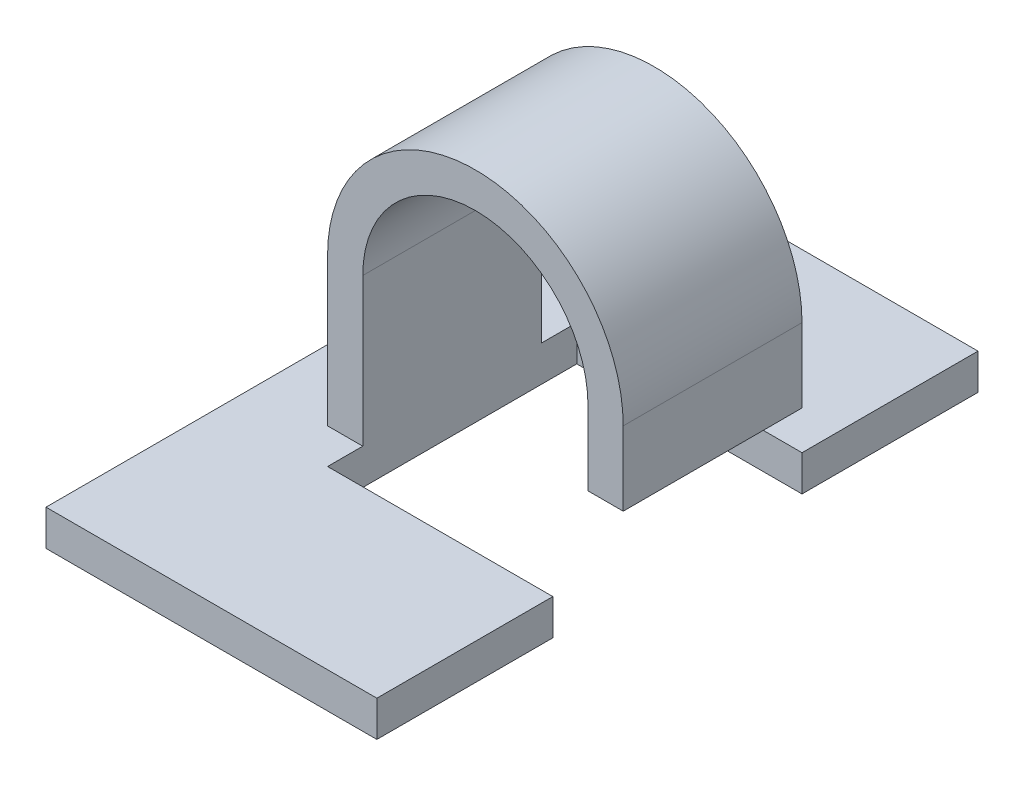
ISO-10303-21;
HEADER;
FILE_DESCRIPTION(('STEP AP214'),'2;1');
FILE_NAME('part.step','',(''),(''),'','','');
FILE_SCHEMA(('AUTOMOTIVE_DESIGN { 1 0 10303 214 1 1 1 1 }'));
ENDSEC;
DATA;
#1=APPLICATION_CONTEXT('core data for automotive mechanical design processes');
#2=APPLICATION_PROTOCOL_DEFINITION('international standard','automotive_design',2000,#1);
#3=PRODUCT_CONTEXT('',#1,'mechanical');
#4=PRODUCT('Part','Part','',(#3));
#5=PRODUCT_RELATED_PRODUCT_CATEGORY('part','',(#4));
#6=PRODUCT_DEFINITION_FORMATION('','',#4);
#7=PRODUCT_DEFINITION_CONTEXT('part definition',#1,'design');
#8=PRODUCT_DEFINITION('design','',#6,#7);
#9=PRODUCT_DEFINITION_SHAPE('','',#8);
#10=(LENGTH_UNIT() NAMED_UNIT(*) SI_UNIT(.MILLI.,.METRE.));
#11=(NAMED_UNIT(*) PLANE_ANGLE_UNIT() SI_UNIT($,.RADIAN.));
#12=(NAMED_UNIT(*) SI_UNIT($,.STERADIAN.) SOLID_ANGLE_UNIT());
#13=UNCERTAINTY_MEASURE_WITH_UNIT(LENGTH_MEASURE(1.E-05),#10,'distance_accuracy_value','');
#14=(GEOMETRIC_REPRESENTATION_CONTEXT(3) GLOBAL_UNCERTAINTY_ASSIGNED_CONTEXT((#13)) GLOBAL_UNIT_ASSIGNED_CONTEXT((#10,
#11,#12)) REPRESENTATION_CONTEXT('',''));
#15=CARTESIAN_POINT('',(0.,0.,0.));
#16=DIRECTION('',(0.,0.,1.));
#17=DIRECTION('',(1.,0.,0.));
#18=AXIS2_PLACEMENT_3D('',#15,#16,#17);
#19=CARTESIAN_POINT('',(0.,0.,-2.54));
#20=DIRECTION('',(0.,0.,1.));
#21=DIRECTION('',(1.,0.,0.));
#22=AXIS2_PLACEMENT_3D('',#19,#20,#21);
#23=CYLINDRICAL_SURFACE('',#22,3.2);
#24=CARTESIAN_POINT('',(0.,0.,2.54));
#25=DIRECTION('',(0.,0.,-1.));
#26=DIRECTION('',(-1.,0.,0.));
#27=AXIS2_PLACEMENT_3D('',#24,#25,#26);
#28=CIRCLE('',#27,3.2);
#29=CARTESIAN_POINT('',(-3.2,0.,2.54));
#30=VERTEX_POINT('',#29);
#31=CARTESIAN_POINT('',(3.2,0.,2.54));
#32=VERTEX_POINT('',#31);
#33=EDGE_CURVE('E141',#30,#32,#28,.T.);
#34=ORIENTED_EDGE('',*,*,#33,.F.);
#35=DIRECTION('',(0.,0.,1.));
#36=VECTOR('',#35,1.);
#37=CARTESIAN_POINT('',(-3.2,0.,-2.54));
#38=LINE('',#37,#36);
#39=CARTESIAN_POINT('',(-3.2,0.,-2.54));
#40=VERTEX_POINT('',#39);
#41=EDGE_CURVE('E11',#40,#30,#38,.T.);
#42=ORIENTED_EDGE('',*,*,#41,.F.);
#43=CARTESIAN_POINT('',(0.,0.,-2.54));
#44=DIRECTION('',(0.,0.,-1.));
#45=DIRECTION('',(-1.,0.,0.));
#46=AXIS2_PLACEMENT_3D('',#43,#44,#45);
#47=CIRCLE('',#46,3.2);
#48=CARTESIAN_POINT('',(3.2,0.,-2.54));
#49=VERTEX_POINT('',#48);
#50=EDGE_CURVE('E152',#40,#49,#47,.T.);
#51=ORIENTED_EDGE('',*,*,#50,.T.);
#52=DIRECTION('',(0.,0.,1.));
#53=VECTOR('',#52,1.);
#54=CARTESIAN_POINT('',(3.2,0.,-2.54));
#55=LINE('',#54,#53);
#56=EDGE_CURVE('E94',#49,#32,#55,.T.);
#57=ORIENTED_EDGE('',*,*,#56,.T.);
#58=EDGE_LOOP('',(#34,#42,#51,#57));
#59=FACE_BOUND('',#58,.T.);
#60=ADVANCED_FACE('F36',(#59),#23,.F.);
#61=CARTESIAN_POINT('',(-3.2,-4.2,-2.54));
#62=DIRECTION('',(1.,0.,0.));
#63=DIRECTION('',(0.,0.,-1.));
#64=AXIS2_PLACEMENT_3D('',#61,#62,#63);
#65=PLANE('',#64);
#66=DIRECTION('',(0.,1.,0.));
#67=VECTOR('',#66,1.);
#68=CARTESIAN_POINT('',(-3.2,-4.2,2.54));
#69=LINE('',#68,#67);
#70=CARTESIAN_POINT('',(-3.2,-4.2,2.54));
#71=VERTEX_POINT('',#70);
#72=EDGE_CURVE('E150',#71,#30,#69,.T.);
#73=ORIENTED_EDGE('',*,*,#72,.F.);
#74=DIRECTION('',(0.,0.,1.));
#75=VECTOR('',#74,1.);
#76=CARTESIAN_POINT('',(-3.2,-4.2,3.54));
#77=LINE('',#76,#75);
#78=CARTESIAN_POINT('',(-3.2,-4.2,3.54));
#79=VERTEX_POINT('',#78);
#80=EDGE_CURVE('E158',#71,#79,#77,.T.);
#81=ORIENTED_EDGE('',*,*,#80,.T.);
#82=DIRECTION('',(0.,1.,0.));
#83=VECTOR('',#82,1.);
#84=CARTESIAN_POINT('',(-3.2,-5.216,3.54));
#85=LINE('',#84,#83);
#86=CARTESIAN_POINT('',(-3.2,-5.216,3.54));
#87=VERTEX_POINT('',#86);
#88=EDGE_CURVE('E319',#87,#79,#85,.T.);
#89=ORIENTED_EDGE('',*,*,#88,.F.);
#90=DIRECTION('',(0.,0.,1.));
#91=VECTOR('',#90,1.);
#92=CARTESIAN_POINT('',(-3.2,-5.216,3.54));
#93=LINE('',#92,#91);
#94=CARTESIAN_POINT('',(-3.2,-5.216,-3.54));
#95=VERTEX_POINT('',#94);
#96=EDGE_CURVE('E326',#95,#87,#93,.T.);
#97=ORIENTED_EDGE('',*,*,#96,.F.);
#98=DIRECTION('',(0.,1.,0.));
#99=VECTOR('',#98,1.);
#100=CARTESIAN_POINT('',(-3.2,-5.216,-3.54));
#101=LINE('',#100,#99);
#102=CARTESIAN_POINT('',(-3.2,-4.2,-3.54));
#103=VERTEX_POINT('',#102);
#104=EDGE_CURVE('E288',#95,#103,#101,.T.);
#105=ORIENTED_EDGE('',*,*,#104,.T.);
#106=CARTESIAN_POINT('',(-3.2,-4.2,-2.54));
#107=VERTEX_POINT('',#106);
#108=EDGE_CURVE('E192',#103,#107,#77,.T.);
#109=ORIENTED_EDGE('',*,*,#108,.T.);
#110=DIRECTION('',(0.,1.,0.));
#111=VECTOR('',#110,1.);
#112=CARTESIAN_POINT('',(-3.2,-4.2,-2.54));
#113=LINE('',#112,#111);
#114=EDGE_CURVE('E146',#107,#40,#113,.T.);
#115=ORIENTED_EDGE('',*,*,#114,.T.);
#116=ORIENTED_EDGE('',*,*,#41,.T.);
#117=EDGE_LOOP('',(#73,#81,#89,#97,#105,#109,#115,#116));
#118=FACE_BOUND('',#117,.T.);
#119=ADVANCED_FACE('F189',(#118),#65,.T.);
#120=CARTESIAN_POINT('',(-4.2,0.,-2.54));
#121=DIRECTION('',(-1.,0.,0.));
#122=DIRECTION('',(0.,0.,1.));
#123=AXIS2_PLACEMENT_3D('',#120,#121,#122);
#124=PLANE('',#123);
#125=DIRECTION('',(0.,-1.,0.));
#126=VECTOR('',#125,1.);
#127=CARTESIAN_POINT('',(-4.2,0.,2.54));
#128=LINE('',#127,#126);
#129=CARTESIAN_POINT('',(-4.2,0.,2.54));
#130=VERTEX_POINT('',#129);
#131=CARTESIAN_POINT('',(-4.2,-4.2,2.54));
#132=VERTEX_POINT('',#131);
#133=EDGE_CURVE('E115',#130,#132,#128,.T.);
#134=ORIENTED_EDGE('',*,*,#133,.F.);
#135=DIRECTION('',(0.,0.,1.));
#136=VECTOR('',#135,1.);
#137=CARTESIAN_POINT('',(-4.2,0.,-2.54));
#138=LINE('',#137,#136);
#139=CARTESIAN_POINT('',(-4.2,0.,-2.54));
#140=VERTEX_POINT('',#139);
#141=EDGE_CURVE('E110',#140,#130,#138,.T.);
#142=ORIENTED_EDGE('',*,*,#141,.F.);
#143=DIRECTION('',(0.,-1.,0.));
#144=VECTOR('',#143,1.);
#145=CARTESIAN_POINT('',(-4.2,0.,-2.54));
#146=LINE('',#145,#144);
#147=CARTESIAN_POINT('',(-4.2,-4.2,-2.54));
#148=VERTEX_POINT('',#147);
#149=EDGE_CURVE('E113',#140,#148,#146,.T.);
#150=ORIENTED_EDGE('',*,*,#149,.T.);
#151=DIRECTION('',(0.,0.,1.));
#152=VECTOR('',#151,1.);
#153=CARTESIAN_POINT('',(-4.2,-4.2,-2.54));
#154=LINE('',#153,#152);
#155=EDGE_CURVE('E45',#148,#132,#154,.T.);
#156=ORIENTED_EDGE('',*,*,#155,.T.);
#157=EDGE_LOOP('',(#134,#142,#150,#156));
#158=FACE_BOUND('',#157,.T.);
#159=ADVANCED_FACE('F112',(#158),#124,.T.);
#160=CARTESIAN_POINT('',(0.,0.,-2.54));
#161=DIRECTION('',(0.,0.,1.));
#162=DIRECTION('',(1.,0.,0.));
#163=AXIS2_PLACEMENT_3D('',#160,#161,#162);
#164=CYLINDRICAL_SURFACE('',#163,4.2);
#165=CARTESIAN_POINT('',(0.,0.,2.54));
#166=DIRECTION('',(0.,0.,1.));
#167=DIRECTION('',(1.,0.,0.));
#168=AXIS2_PLACEMENT_3D('',#165,#166,#167);
#169=CIRCLE('',#168,4.2);
#170=CARTESIAN_POINT('',(4.2,0.,2.54));
#171=VERTEX_POINT('',#170);
#172=EDGE_CURVE('E182',#171,#130,#169,.T.);
#173=ORIENTED_EDGE('',*,*,#172,.F.);
#174=DIRECTION('',(0.,0.,1.));
#175=VECTOR('',#174,1.);
#176=CARTESIAN_POINT('',(4.2,0.,-2.54));
#177=LINE('',#176,#175);
#178=CARTESIAN_POINT('',(4.2,0.,-2.54));
#179=VERTEX_POINT('',#178);
#180=EDGE_CURVE('E120',#179,#171,#177,.T.);
#181=ORIENTED_EDGE('',*,*,#180,.F.);
#182=CARTESIAN_POINT('',(0.,0.,-2.54));
#183=DIRECTION('',(0.,0.,1.));
#184=DIRECTION('',(1.,0.,0.));
#185=AXIS2_PLACEMENT_3D('',#182,#183,#184);
#186=CIRCLE('',#185,4.2);
#187=EDGE_CURVE('E126',#179,#140,#186,.T.);
#188=ORIENTED_EDGE('',*,*,#187,.T.);
#189=ORIENTED_EDGE('',*,*,#141,.T.);
#190=EDGE_LOOP('',(#173,#181,#188,#189));
#191=FACE_BOUND('',#190,.T.);
#192=ADVANCED_FACE('F132',(#191),#164,.T.);
#193=CARTESIAN_POINT('',(4.2,-2.1,-2.54));
#194=DIRECTION('',(1.,0.,0.));
#195=DIRECTION('',(0.,0.,-1.));
#196=AXIS2_PLACEMENT_3D('',#193,#194,#195);
#197=PLANE('',#196);
#198=DIRECTION('',(0.,1.,0.));
#199=VECTOR('',#198,1.);
#200=CARTESIAN_POINT('',(4.2,-2.1,2.54));
#201=LINE('',#200,#199);
#202=CARTESIAN_POINT('',(4.2,-2.1,2.54));
#203=VERTEX_POINT('',#202);
#204=EDGE_CURVE('E176',#203,#171,#201,.T.);
#205=ORIENTED_EDGE('',*,*,#204,.F.);
#206=DIRECTION('',(0.,0.,1.));
#207=VECTOR('',#206,1.);
#208=CARTESIAN_POINT('',(4.2,-2.1,-2.54));
#209=LINE('',#208,#207);
#210=CARTESIAN_POINT('',(4.2,-2.1,-2.54));
#211=VERTEX_POINT('',#210);
#212=EDGE_CURVE('E166',#211,#203,#209,.T.);
#213=ORIENTED_EDGE('',*,*,#212,.F.);
#214=DIRECTION('',(0.,1.,0.));
#215=VECTOR('',#214,1.);
#216=CARTESIAN_POINT('',(4.2,-2.1,-2.54));
#217=LINE('',#216,#215);
#218=EDGE_CURVE('E133',#211,#179,#217,.T.);
#219=ORIENTED_EDGE('',*,*,#218,.T.);
#220=ORIENTED_EDGE('',*,*,#180,.T.);
#221=EDGE_LOOP('',(#205,#213,#219,#220));
#222=FACE_BOUND('',#221,.T.);
#223=ADVANCED_FACE('F200',(#222),#197,.T.);
#224=CARTESIAN_POINT('',(3.2,-2.1,-2.54));
#225=DIRECTION('',(0.,-1.,0.));
#226=DIRECTION('',(0.,0.,-1.));
#227=AXIS2_PLACEMENT_3D('',#224,#225,#226);
#228=PLANE('',#227);
#229=DIRECTION('',(1.,0.,0.));
#230=VECTOR('',#229,1.);
#231=CARTESIAN_POINT('',(3.2,-2.1,2.54));
#232=LINE('',#231,#230);
#233=CARTESIAN_POINT('',(3.2,-2.1,2.54));
#234=VERTEX_POINT('',#233);
#235=EDGE_CURVE('E174',#234,#203,#232,.T.);
#236=ORIENTED_EDGE('',*,*,#235,.F.);
#237=DIRECTION('',(0.,0.,1.));
#238=VECTOR('',#237,1.);
#239=CARTESIAN_POINT('',(3.2,-2.1,-2.54));
#240=LINE('',#239,#238);
#241=CARTESIAN_POINT('',(3.2,-2.1,-2.54));
#242=VERTEX_POINT('',#241);
#243=EDGE_CURVE('E168',#242,#234,#240,.T.);
#244=ORIENTED_EDGE('',*,*,#243,.F.);
#245=DIRECTION('',(1.,0.,0.));
#246=VECTOR('',#245,1.);
#247=CARTESIAN_POINT('',(3.2,-2.1,-2.54));
#248=LINE('',#247,#246);
#249=EDGE_CURVE('E135',#242,#211,#248,.T.);
#250=ORIENTED_EDGE('',*,*,#249,.T.);
#251=ORIENTED_EDGE('',*,*,#212,.T.);
#252=EDGE_LOOP('',(#236,#244,#250,#251));
#253=FACE_BOUND('',#252,.T.);
#254=ADVANCED_FACE('F165',(#253),#228,.T.);
#255=CARTESIAN_POINT('',(3.2,0.,-2.54));
#256=DIRECTION('',(-1.,0.,0.));
#257=DIRECTION('',(0.,0.,1.));
#258=AXIS2_PLACEMENT_3D('',#255,#256,#257);
#259=PLANE('',#258);
#260=DIRECTION('',(0.,-1.,0.));
#261=VECTOR('',#260,1.);
#262=CARTESIAN_POINT('',(3.2,0.,2.54));
#263=LINE('',#262,#261);
#264=EDGE_CURVE('E171',#32,#234,#263,.T.);
#265=ORIENTED_EDGE('',*,*,#264,.F.);
#266=ORIENTED_EDGE('',*,*,#56,.F.);
#267=DIRECTION('',(0.,-1.,0.));
#268=VECTOR('',#267,1.);
#269=CARTESIAN_POINT('',(3.2,0.,-2.54));
#270=LINE('',#269,#268);
#271=EDGE_CURVE('E154',#49,#242,#270,.T.);
#272=ORIENTED_EDGE('',*,*,#271,.T.);
#273=ORIENTED_EDGE('',*,*,#243,.T.);
#274=EDGE_LOOP('',(#265,#266,#272,#273));
#275=FACE_BOUND('',#274,.T.);
#276=ADVANCED_FACE('F169',(#275),#259,.T.);
#277=CARTESIAN_POINT('',(0.,0.,-2.54));
#278=DIRECTION('',(0.,0.,-1.));
#279=DIRECTION('',(-1.,0.,0.));
#280=AXIS2_PLACEMENT_3D('',#277,#278,#279);
#281=PLANE('',#280);
#282=ORIENTED_EDGE('',*,*,#50,.F.);
#283=ORIENTED_EDGE('',*,*,#114,.F.);
#284=DIRECTION('',(1.,0.,0.));
#285=VECTOR('',#284,1.);
#286=CARTESIAN_POINT('',(-4.2,-4.2,-2.54));
#287=LINE('',#286,#285);
#288=EDGE_CURVE('E130',#148,#107,#287,.T.);
#289=ORIENTED_EDGE('',*,*,#288,.F.);
#290=ORIENTED_EDGE('',*,*,#149,.F.);
#291=ORIENTED_EDGE('',*,*,#187,.F.);
#292=ORIENTED_EDGE('',*,*,#218,.F.);
#293=ORIENTED_EDGE('',*,*,#249,.F.);
#294=ORIENTED_EDGE('',*,*,#271,.F.);
#295=EDGE_LOOP('',(#282,#283,#289,#290,#291,#292,#293,#294));
#296=FACE_BOUND('',#295,.T.);
#297=ADVANCED_FACE('F124',(#296),#281,.T.);
#298=CARTESIAN_POINT('',(0.,0.,2.54));
#299=DIRECTION('',(0.,0.,-1.));
#300=DIRECTION('',(-1.,0.,0.));
#301=AXIS2_PLACEMENT_3D('',#298,#299,#300);
#302=PLANE('',#301);
#303=ORIENTED_EDGE('',*,*,#33,.T.);
#304=ORIENTED_EDGE('',*,*,#264,.T.);
#305=ORIENTED_EDGE('',*,*,#235,.T.);
#306=ORIENTED_EDGE('',*,*,#204,.T.);
#307=ORIENTED_EDGE('',*,*,#172,.T.);
#308=ORIENTED_EDGE('',*,*,#133,.T.);
#309=DIRECTION('',(1.,0.,0.));
#310=VECTOR('',#309,1.);
#311=CARTESIAN_POINT('',(-4.2,-4.2,2.54));
#312=LINE('',#311,#310);
#313=EDGE_CURVE('E83',#132,#71,#312,.T.);
#314=ORIENTED_EDGE('',*,*,#313,.T.);
#315=ORIENTED_EDGE('',*,*,#72,.T.);
#316=EDGE_LOOP('',(#303,#304,#305,#306,#307,#308,#314,#315));
#317=FACE_BOUND('',#316,.T.);
#318=ADVANCED_FACE('F178',(#317),#302,.F.);
#319=CARTESIAN_POINT('',(-6.2,-4.2,-8.54));
#320=DIRECTION('',(0.,1.,0.));
#321=DIRECTION('',(0.,0.,1.));
#322=AXIS2_PLACEMENT_3D('',#319,#320,#321);
#323=PLANE('',#322);
#324=ORIENTED_EDGE('',*,*,#313,.F.);
#325=ORIENTED_EDGE('',*,*,#155,.F.);
#326=ORIENTED_EDGE('',*,*,#288,.T.);
#327=ORIENTED_EDGE('',*,*,#108,.F.);
#328=DIRECTION('',(-1.,0.,0.));
#329=VECTOR('',#328,1.);
#330=CARTESIAN_POINT('',(-3.2,-4.2,-3.54));
#331=LINE('',#330,#329);
#332=CARTESIAN_POINT('',(3.2,-4.2,-3.54));
#333=VERTEX_POINT('',#332);
#334=EDGE_CURVE('E295',#333,#103,#331,.T.);
#335=ORIENTED_EDGE('',*,*,#334,.F.);
#336=DIRECTION('',(0.,0.,1.));
#337=VECTOR('',#336,1.);
#338=CARTESIAN_POINT('',(3.2,-4.2,-3.54));
#339=LINE('',#338,#337);
#340=CARTESIAN_POINT('',(3.2,-4.2,-8.54));
#341=VERTEX_POINT('',#340);
#342=EDGE_CURVE('E360',#341,#333,#339,.T.);
#343=ORIENTED_EDGE('',*,*,#342,.F.);
#344=DIRECTION('',(1.,0.,0.));
#345=VECTOR('',#344,1.);
#346=CARTESIAN_POINT('',(3.2,-4.2,-8.54));
#347=LINE('',#346,#345);
#348=CARTESIAN_POINT('',(-6.2,-4.2,-8.54));
#349=VERTEX_POINT('',#348);
#350=EDGE_CURVE('E283',#349,#341,#347,.T.);
#351=ORIENTED_EDGE('',*,*,#350,.F.);
#352=DIRECTION('',(0.,0.,-1.));
#353=VECTOR('',#352,1.);
#354=CARTESIAN_POINT('',(-6.2,-4.2,-8.54));
#355=LINE('',#354,#353);
#356=CARTESIAN_POINT('',(-6.2,-4.2,8.54));
#357=VERTEX_POINT('',#356);
#358=EDGE_CURVE('E277',#357,#349,#355,.T.);
#359=ORIENTED_EDGE('',*,*,#358,.F.);
#360=DIRECTION('',(-1.,0.,0.));
#361=VECTOR('',#360,1.);
#362=CARTESIAN_POINT('',(-6.2,-4.2,8.54));
#363=LINE('',#362,#361);
#364=CARTESIAN_POINT('',(3.2,-4.2,8.54));
#365=VERTEX_POINT('',#364);
#366=EDGE_CURVE('E303',#365,#357,#363,.T.);
#367=ORIENTED_EDGE('',*,*,#366,.F.);
#368=DIRECTION('',(0.,0.,1.));
#369=VECTOR('',#368,1.);
#370=CARTESIAN_POINT('',(3.2,-4.2,8.54));
#371=LINE('',#370,#369);
#372=CARTESIAN_POINT('',(3.2,-4.2,3.54));
#373=VERTEX_POINT('',#372);
#374=EDGE_CURVE('E300',#373,#365,#371,.T.);
#375=ORIENTED_EDGE('',*,*,#374,.F.);
#376=DIRECTION('',(1.,0.,0.));
#377=VECTOR('',#376,1.);
#378=CARTESIAN_POINT('',(3.2,-4.2,3.54));
#379=LINE('',#378,#377);
#380=EDGE_CURVE('E291',#79,#373,#379,.T.);
#381=ORIENTED_EDGE('',*,*,#380,.F.);
#382=ORIENTED_EDGE('',*,*,#80,.F.);
#383=EDGE_LOOP('',(#324,#325,#326,#327,#335,#343,#351,#359,#367,#375,#381,#382));
#384=FACE_BOUND('',#383,.T.);
#385=ADVANCED_FACE('F195',(#384),#323,.T.);
#386=CARTESIAN_POINT('',(3.2,-5.216,-8.54));
#387=DIRECTION('',(0.,0.,1.));
#388=DIRECTION('',(1.,0.,0.));
#389=AXIS2_PLACEMENT_3D('',#386,#387,#388);
#390=PLANE('',#389);
#391=ORIENTED_EDGE('',*,*,#350,.T.);
#392=DIRECTION('',(0.,1.,0.));
#393=VECTOR('',#392,1.);
#394=CARTESIAN_POINT('',(3.2,-5.216,-8.54));
#395=LINE('',#394,#393);
#396=CARTESIAN_POINT('',(3.2,-5.216,-8.54));
#397=VERTEX_POINT('',#396);
#398=EDGE_CURVE('E179',#397,#341,#395,.T.);
#399=ORIENTED_EDGE('',*,*,#398,.F.);
#400=DIRECTION('',(1.,0.,0.));
#401=VECTOR('',#400,1.);
#402=CARTESIAN_POINT('',(3.2,-5.216,-8.54));
#403=LINE('',#402,#401);
#404=CARTESIAN_POINT('',(-6.2,-5.216,-8.54));
#405=VERTEX_POINT('',#404);
#406=EDGE_CURVE('E263',#405,#397,#403,.T.);
#407=ORIENTED_EDGE('',*,*,#406,.F.);
#408=DIRECTION('',(0.,1.,0.));
#409=VECTOR('',#408,1.);
#410=CARTESIAN_POINT('',(-6.2,-5.216,-8.54));
#411=LINE('',#410,#409);
#412=EDGE_CURVE('E308',#405,#349,#411,.T.);
#413=ORIENTED_EDGE('',*,*,#412,.T.);
#414=EDGE_LOOP('',(#391,#399,#407,#413));
#415=FACE_BOUND('',#414,.T.);
#416=ADVANCED_FACE('F223',(#415),#390,.F.);
#417=CARTESIAN_POINT('',(3.2,-5.216,-3.54));
#418=DIRECTION('',(-1.,0.,0.));
#419=DIRECTION('',(0.,0.,1.));
#420=AXIS2_PLACEMENT_3D('',#417,#418,#419);
#421=PLANE('',#420);
#422=ORIENTED_EDGE('',*,*,#342,.T.);
#423=DIRECTION('',(0.,1.,0.));
#424=VECTOR('',#423,1.);
#425=CARTESIAN_POINT('',(3.2,-5.216,-3.54));
#426=LINE('',#425,#424);
#427=CARTESIAN_POINT('',(3.2,-5.216,-3.54));
#428=VERTEX_POINT('',#427);
#429=EDGE_CURVE('E285',#428,#333,#426,.T.);
#430=ORIENTED_EDGE('',*,*,#429,.F.);
#431=DIRECTION('',(0.,0.,1.));
#432=VECTOR('',#431,1.);
#433=CARTESIAN_POINT('',(3.2,-5.216,-3.54));
#434=LINE('',#433,#432);
#435=EDGE_CURVE('E268',#397,#428,#434,.T.);
#436=ORIENTED_EDGE('',*,*,#435,.F.);
#437=ORIENTED_EDGE('',*,*,#398,.T.);
#438=EDGE_LOOP('',(#422,#430,#436,#437));
#439=FACE_BOUND('',#438,.T.);
#440=ADVANCED_FACE('F226',(#439),#421,.F.);
#441=CARTESIAN_POINT('',(-3.2,-5.216,-3.54));
#442=DIRECTION('',(0.,0.,-1.));
#443=DIRECTION('',(-1.,0.,0.));
#444=AXIS2_PLACEMENT_3D('',#441,#442,#443);
#445=PLANE('',#444);
#446=ORIENTED_EDGE('',*,*,#334,.T.);
#447=ORIENTED_EDGE('',*,*,#104,.F.);
#448=DIRECTION('',(-1.,0.,0.));
#449=VECTOR('',#448,1.);
#450=CARTESIAN_POINT('',(-3.2,-5.216,-3.54));
#451=LINE('',#450,#449);
#452=EDGE_CURVE('E332',#428,#95,#451,.T.);
#453=ORIENTED_EDGE('',*,*,#452,.F.);
#454=ORIENTED_EDGE('',*,*,#429,.T.);
#455=EDGE_LOOP('',(#446,#447,#453,#454));
#456=FACE_BOUND('',#455,.T.);
#457=ADVANCED_FACE('F230',(#456),#445,.F.);
#458=CARTESIAN_POINT('',(3.2,-5.216,3.54));
#459=DIRECTION('',(0.,0.,1.));
#460=DIRECTION('',(1.,0.,0.));
#461=AXIS2_PLACEMENT_3D('',#458,#459,#460);
#462=PLANE('',#461);
#463=ORIENTED_EDGE('',*,*,#380,.T.);
#464=DIRECTION('',(0.,1.,0.));
#465=VECTOR('',#464,1.);
#466=CARTESIAN_POINT('',(3.2,-5.216,3.54));
#467=LINE('',#466,#465);
#468=CARTESIAN_POINT('',(3.2,-5.216,3.54));
#469=VERTEX_POINT('',#468);
#470=EDGE_CURVE('E316',#469,#373,#467,.T.);
#471=ORIENTED_EDGE('',*,*,#470,.F.);
#472=DIRECTION('',(1.,0.,0.));
#473=VECTOR('',#472,1.);
#474=CARTESIAN_POINT('',(3.2,-5.216,3.54));
#475=LINE('',#474,#473);
#476=EDGE_CURVE('E368',#87,#469,#475,.T.);
#477=ORIENTED_EDGE('',*,*,#476,.F.);
#478=ORIENTED_EDGE('',*,*,#88,.T.);
#479=EDGE_LOOP('',(#463,#471,#477,#478));
#480=FACE_BOUND('',#479,.T.);
#481=ADVANCED_FACE('F234',(#480),#462,.F.);
#482=CARTESIAN_POINT('',(3.2,-5.216,8.54));
#483=DIRECTION('',(-1.,0.,0.));
#484=DIRECTION('',(0.,0.,1.));
#485=AXIS2_PLACEMENT_3D('',#482,#483,#484);
#486=PLANE('',#485);
#487=ORIENTED_EDGE('',*,*,#374,.T.);
#488=DIRECTION('',(0.,1.,0.));
#489=VECTOR('',#488,1.);
#490=CARTESIAN_POINT('',(3.2,-5.216,8.54));
#491=LINE('',#490,#489);
#492=CARTESIAN_POINT('',(3.2,-5.216,8.54));
#493=VERTEX_POINT('',#492);
#494=EDGE_CURVE('E313',#493,#365,#491,.T.);
#495=ORIENTED_EDGE('',*,*,#494,.F.);
#496=DIRECTION('',(0.,0.,1.));
#497=VECTOR('',#496,1.);
#498=CARTESIAN_POINT('',(3.2,-5.216,8.54));
#499=LINE('',#498,#497);
#500=EDGE_CURVE('E366',#469,#493,#499,.T.);
#501=ORIENTED_EDGE('',*,*,#500,.F.);
#502=ORIENTED_EDGE('',*,*,#470,.T.);
#503=EDGE_LOOP('',(#487,#495,#501,#502));
#504=FACE_BOUND('',#503,.T.);
#505=ADVANCED_FACE('F238',(#504),#486,.F.);
#506=CARTESIAN_POINT('',(-6.2,-5.216,8.54));
#507=DIRECTION('',(0.,0.,-1.));
#508=DIRECTION('',(-1.,0.,0.));
#509=AXIS2_PLACEMENT_3D('',#506,#507,#508);
#510=PLANE('',#509);
#511=ORIENTED_EDGE('',*,*,#366,.T.);
#512=DIRECTION('',(0.,1.,0.));
#513=VECTOR('',#512,1.);
#514=CARTESIAN_POINT('',(-6.2,-5.216,8.54));
#515=LINE('',#514,#513);
#516=CARTESIAN_POINT('',(-6.2,-5.216,8.54));
#517=VERTEX_POINT('',#516);
#518=EDGE_CURVE('E310',#517,#357,#515,.T.);
#519=ORIENTED_EDGE('',*,*,#518,.F.);
#520=DIRECTION('',(-1.,0.,0.));
#521=VECTOR('',#520,1.);
#522=CARTESIAN_POINT('',(-6.2,-5.216,8.54));
#523=LINE('',#522,#521);
#524=EDGE_CURVE('E364',#493,#517,#523,.T.);
#525=ORIENTED_EDGE('',*,*,#524,.F.);
#526=ORIENTED_EDGE('',*,*,#494,.T.);
#527=EDGE_LOOP('',(#511,#519,#525,#526));
#528=FACE_BOUND('',#527,.T.);
#529=ADVANCED_FACE('F242',(#528),#510,.F.);
#530=CARTESIAN_POINT('',(-6.2,-5.216,-8.54));
#531=DIRECTION('',(1.,0.,0.));
#532=DIRECTION('',(0.,0.,-1.));
#533=AXIS2_PLACEMENT_3D('',#530,#531,#532);
#534=PLANE('',#533);
#535=ORIENTED_EDGE('',*,*,#358,.T.);
#536=ORIENTED_EDGE('',*,*,#412,.F.);
#537=DIRECTION('',(0.,0.,-1.));
#538=VECTOR('',#537,1.);
#539=CARTESIAN_POINT('',(-6.2,-5.216,-8.54));
#540=LINE('',#539,#538);
#541=EDGE_CURVE('E272',#517,#405,#540,.T.);
#542=ORIENTED_EDGE('',*,*,#541,.F.);
#543=ORIENTED_EDGE('',*,*,#518,.T.);
#544=EDGE_LOOP('',(#535,#536,#542,#543));
#545=FACE_BOUND('',#544,.T.);
#546=ADVANCED_FACE('F246',(#545),#534,.F.);
#547=CARTESIAN_POINT('',(-6.2,-5.216,-8.54));
#548=DIRECTION('',(0.,1.,0.));
#549=DIRECTION('',(0.,0.,1.));
#550=AXIS2_PLACEMENT_3D('',#547,#548,#549);
#551=PLANE('',#550);
#552=ORIENTED_EDGE('',*,*,#406,.T.);
#553=ORIENTED_EDGE('',*,*,#435,.T.);
#554=ORIENTED_EDGE('',*,*,#452,.T.);
#555=ORIENTED_EDGE('',*,*,#96,.T.);
#556=ORIENTED_EDGE('',*,*,#476,.T.);
#557=ORIENTED_EDGE('',*,*,#500,.T.);
#558=ORIENTED_EDGE('',*,*,#524,.T.);
#559=ORIENTED_EDGE('',*,*,#541,.T.);
#560=EDGE_LOOP('',(#552,#553,#554,#555,#556,#557,#558,#559));
#561=FACE_BOUND('',#560,.T.);
#562=ADVANCED_FACE('F250',(#561),#551,.F.);
#563=CLOSED_SHELL('',(#60,#119,#159,#192,#223,#254,#276,#297,#318,#385,#416,#440,#457,#481,#505,
#529,#546,#562));
#564=MANIFOLD_SOLID_BREP('B2',#563);
#565=ADVANCED_BREP_SHAPE_REPRESENTATION('',(#18,#564),#14);
#566=SHAPE_DEFINITION_REPRESENTATION(#9,#565);
ENDSEC;
END-ISO-10303-21;
